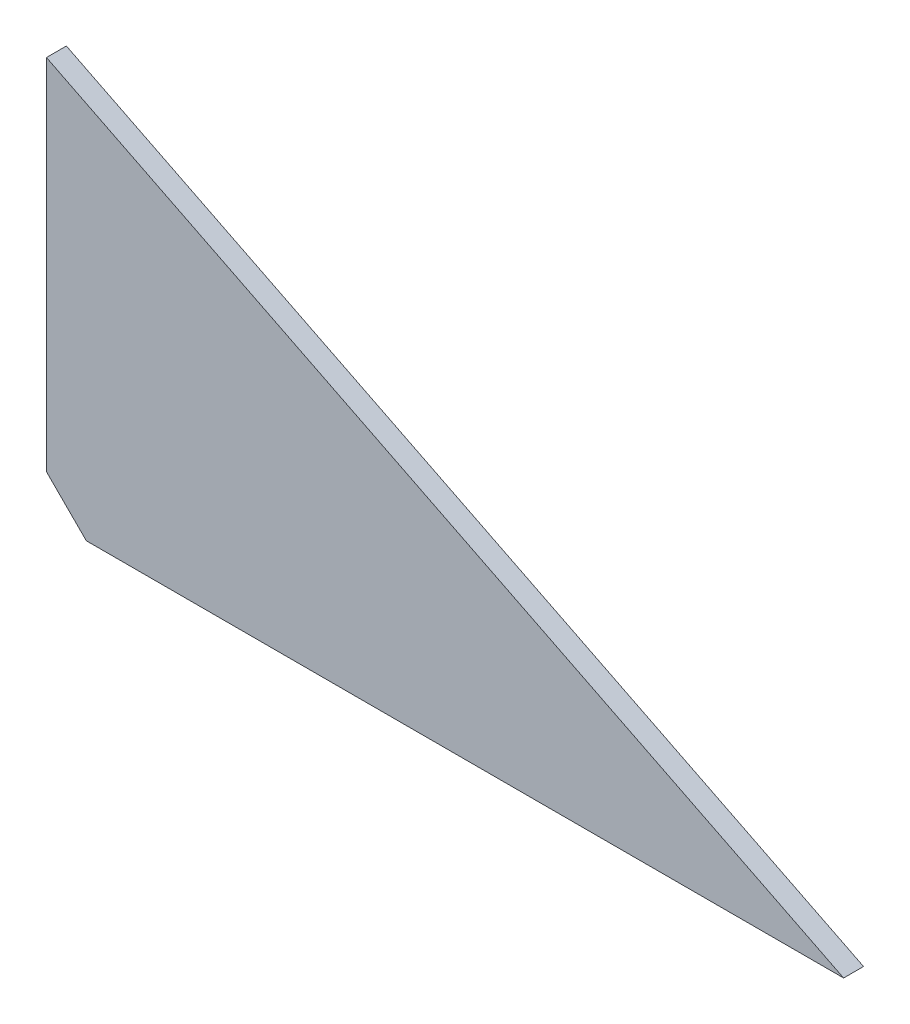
from build123d import *

# Parameters (mm, degrees)
BOSS_EXTRU_1_DEPTH = 2.5
CHANFREIN1_SIZE    = 10


with BuildPart() as part:
    # Esquisse1 → Boss.-Extru.1 (new, symmetric)
    with BuildSketch(Plane.XY):
        Polygon((0, 100), (200, 0), (0, 0), align=None)
    extrude(amount=BOSS_EXTRU_1_DEPTH, both=True)

    # Chanfrein1
    chanfrein1_edges = [part.edges().sort_by_distance(p)[0] for p in [
        (0, 0, 0),
    ]]
    chamfer(chanfrein1_edges, length=CHANFREIN1_SIZE)


solid = part.part
